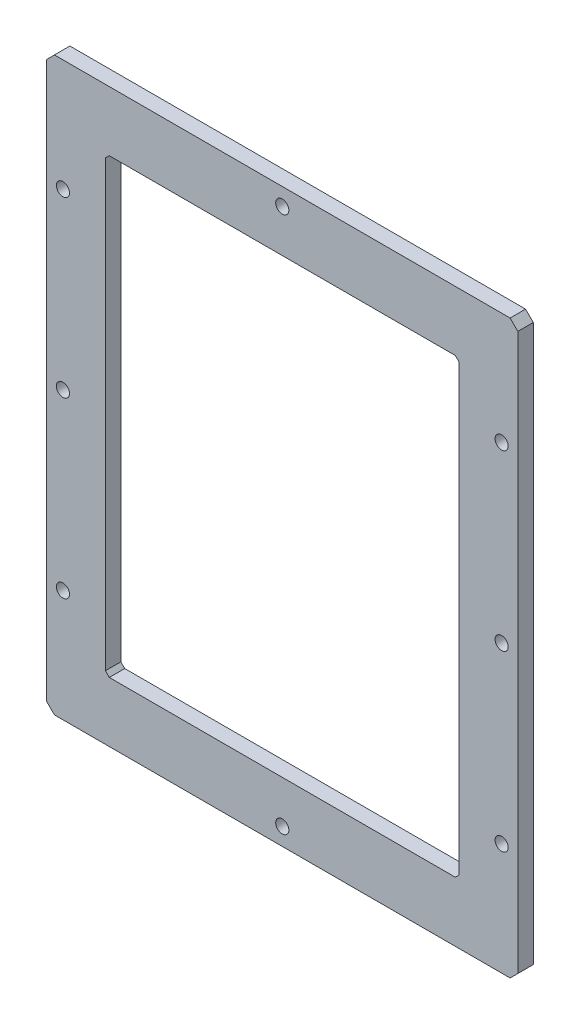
ISO-10303-21;
HEADER;
FILE_DESCRIPTION(('STEP AP214'),'2;1');
FILE_NAME('part.step','',(''),(''),'','','');
FILE_SCHEMA(('AUTOMOTIVE_DESIGN { 1 0 10303 214 1 1 1 1 }'));
ENDSEC;
DATA;
#1=APPLICATION_CONTEXT('core data for automotive mechanical design processes');
#2=APPLICATION_PROTOCOL_DEFINITION('international standard','automotive_design',2000,#1);
#3=PRODUCT_CONTEXT('',#1,'mechanical');
#4=PRODUCT('Part','Part','',(#3));
#5=PRODUCT_RELATED_PRODUCT_CATEGORY('part','',(#4));
#6=PRODUCT_DEFINITION_FORMATION('','',#4);
#7=PRODUCT_DEFINITION_CONTEXT('part definition',#1,'design');
#8=PRODUCT_DEFINITION('design','',#6,#7);
#9=PRODUCT_DEFINITION_SHAPE('','',#8);
#10=(LENGTH_UNIT() NAMED_UNIT(*) SI_UNIT(.MILLI.,.METRE.));
#11=(NAMED_UNIT(*) PLANE_ANGLE_UNIT() SI_UNIT($,.RADIAN.));
#12=(NAMED_UNIT(*) SI_UNIT($,.STERADIAN.) SOLID_ANGLE_UNIT());
#13=UNCERTAINTY_MEASURE_WITH_UNIT(LENGTH_MEASURE(1.E-05),#10,'distance_accuracy_value','');
#14=(GEOMETRIC_REPRESENTATION_CONTEXT(3) GLOBAL_UNCERTAINTY_ASSIGNED_CONTEXT((#13)) GLOBAL_UNIT_ASSIGNED_CONTEXT((#10,
#11,#12)) REPRESENTATION_CONTEXT('',''));
#15=CARTESIAN_POINT('',(0.,0.,0.));
#16=DIRECTION('',(0.,0.,1.));
#17=DIRECTION('',(1.,0.,0.));
#18=AXIS2_PLACEMENT_3D('',#15,#16,#17);
#19=CARTESIAN_POINT('',(0.,0.,4.));
#20=DIRECTION('',(0.,0.,1.));
#21=DIRECTION('',(1.,0.,0.));
#22=AXIS2_PLACEMENT_3D('',#19,#20,#21);
#23=PLANE('',#22);
#24=CARTESIAN_POINT('',(0.,-69.5,4.));
#25=DIRECTION('',(0.,0.,1.));
#26=DIRECTION('',(1.,0.,0.));
#27=AXIS2_PLACEMENT_3D('',#24,#25,#26);
#28=CIRCLE('',#27,1.7);
#29=CARTESIAN_POINT('',(1.7,-69.5,4.));
#30=VERTEX_POINT('',#29);
#31=EDGE_CURVE('E414',#30,#30,#28,.T.);
#32=ORIENTED_EDGE('',*,*,#31,.F.);
#33=EDGE_LOOP('',(#32));
#34=FACE_BOUND('',#33,.T.);
#35=CARTESIAN_POINT('',(56.8,0.,4.));
#36=DIRECTION('',(0.,0.,1.));
#37=DIRECTION('',(1.,0.,0.));
#38=AXIS2_PLACEMENT_3D('',#35,#36,#37);
#39=CIRCLE('',#38,1.7);
#40=CARTESIAN_POINT('',(58.5,0.,4.));
#41=VERTEX_POINT('',#40);
#42=EDGE_CURVE('E426',#41,#41,#39,.T.);
#43=ORIENTED_EDGE('',*,*,#42,.F.);
#44=EDGE_LOOP('',(#43));
#45=FACE_BOUND('',#44,.T.);
#46=CARTESIAN_POINT('',(-56.8,45.,4.));
#47=DIRECTION('',(0.,0.,1.));
#48=DIRECTION('',(1.,0.,0.));
#49=AXIS2_PLACEMENT_3D('',#46,#47,#48);
#50=CIRCLE('',#49,1.7);
#51=CARTESIAN_POINT('',(-55.1,45.,4.));
#52=VERTEX_POINT('',#51);
#53=EDGE_CURVE('E438',#52,#52,#50,.T.);
#54=ORIENTED_EDGE('',*,*,#53,.F.);
#55=EDGE_LOOP('',(#54));
#56=FACE_BOUND('',#55,.T.);
#57=CARTESIAN_POINT('',(-56.8,-45.,4.));
#58=DIRECTION('',(0.,0.,1.));
#59=DIRECTION('',(1.,0.,0.));
#60=AXIS2_PLACEMENT_3D('',#57,#58,#59);
#61=CIRCLE('',#60,1.7);
#62=CARTESIAN_POINT('',(-55.1,-45.,4.));
#63=VERTEX_POINT('',#62);
#64=EDGE_CURVE('E194',#63,#63,#61,.T.);
#65=ORIENTED_EDGE('',*,*,#64,.F.);
#66=EDGE_LOOP('',(#65));
#67=FACE_BOUND('',#66,.T.);
#68=DIRECTION('',(0.707106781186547,-0.707106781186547,0.));
#69=VECTOR('',#68,1.);
#70=CARTESIAN_POINT('',(-61.,-72.,4.));
#71=LINE('',#70,#69);
#72=CARTESIAN_POINT('',(-61.,-72.,4.));
#73=VERTEX_POINT('',#72);
#74=CARTESIAN_POINT('',(-59.,-74.,4.));
#75=VERTEX_POINT('',#74);
#76=EDGE_CURVE('E224',#73,#75,#71,.T.);
#77=ORIENTED_EDGE('',*,*,#76,.T.);
#78=DIRECTION('',(1.,0.,0.));
#79=VECTOR('',#78,1.);
#80=CARTESIAN_POINT('',(-59.,-74.,4.));
#81=LINE('',#80,#79);
#82=CARTESIAN_POINT('',(59.,-74.,4.));
#83=VERTEX_POINT('',#82);
#84=EDGE_CURVE('E227',#75,#83,#81,.T.);
#85=ORIENTED_EDGE('',*,*,#84,.T.);
#86=DIRECTION('',(0.707106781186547,0.707106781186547,0.));
#87=VECTOR('',#86,1.);
#88=CARTESIAN_POINT('',(59.,-74.,4.));
#89=LINE('',#88,#87);
#90=CARTESIAN_POINT('',(61.,-72.,4.));
#91=VERTEX_POINT('',#90);
#92=EDGE_CURVE('E230',#83,#91,#89,.T.);
#93=ORIENTED_EDGE('',*,*,#92,.T.);
#94=DIRECTION('',(0.,1.,0.));
#95=VECTOR('',#94,1.);
#96=CARTESIAN_POINT('',(61.,-72.,4.));
#97=LINE('',#96,#95);
#98=CARTESIAN_POINT('',(61.,72.,4.));
#99=VERTEX_POINT('',#98);
#100=EDGE_CURVE('E232',#91,#99,#97,.T.);
#101=ORIENTED_EDGE('',*,*,#100,.T.);
#102=DIRECTION('',(-0.707106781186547,0.707106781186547,0.));
#103=VECTOR('',#102,1.);
#104=CARTESIAN_POINT('',(61.,72.,4.));
#105=LINE('',#104,#103);
#106=CARTESIAN_POINT('',(59.,74.,4.));
#107=VERTEX_POINT('',#106);
#108=EDGE_CURVE('E234',#99,#107,#105,.T.);
#109=ORIENTED_EDGE('',*,*,#108,.T.);
#110=DIRECTION('',(-1.,0.,0.));
#111=VECTOR('',#110,1.);
#112=CARTESIAN_POINT('',(59.,74.,4.));
#113=LINE('',#112,#111);
#114=CARTESIAN_POINT('',(-59.,74.,4.));
#115=VERTEX_POINT('',#114);
#116=EDGE_CURVE('E236',#107,#115,#113,.T.);
#117=ORIENTED_EDGE('',*,*,#116,.T.);
#118=DIRECTION('',(-0.707106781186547,-0.707106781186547,0.));
#119=VECTOR('',#118,1.);
#120=CARTESIAN_POINT('',(-59.,74.,4.));
#121=LINE('',#120,#119);
#122=CARTESIAN_POINT('',(-61.,72.,4.));
#123=VERTEX_POINT('',#122);
#124=EDGE_CURVE('E238',#115,#123,#121,.T.);
#125=ORIENTED_EDGE('',*,*,#124,.T.);
#126=DIRECTION('',(0.,-1.,0.));
#127=VECTOR('',#126,1.);
#128=CARTESIAN_POINT('',(-61.,72.,4.));
#129=LINE('',#128,#127);
#130=EDGE_CURVE('E240',#123,#73,#129,.T.);
#131=ORIENTED_EDGE('',*,*,#130,.T.);
#132=EDGE_LOOP('',(#77,#85,#93,#101,#109,#117,#125,#131));
#133=FACE_BOUND('',#132,.T.);
#134=DIRECTION('',(1.,0.,0.));
#135=VECTOR('',#134,1.);
#136=CARTESIAN_POINT('',(-44.8,-58.5,4.));
#137=LINE('',#136,#135);
#138=CARTESIAN_POINT('',(-44.8,-58.5,4.));
#139=VERTEX_POINT('',#138);
#140=CARTESIAN_POINT('',(44.8,-58.5,4.));
#141=VERTEX_POINT('',#140);
#142=EDGE_CURVE('E164',#139,#141,#137,.T.);
#143=ORIENTED_EDGE('',*,*,#142,.F.);
#144=DIRECTION('',(0.707106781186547,-0.707106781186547,0.));
#145=VECTOR('',#144,1.);
#146=CARTESIAN_POINT('',(-45.8,-57.5,4.));
#147=LINE('',#146,#145);
#148=CARTESIAN_POINT('',(-45.8,-57.5,4.));
#149=VERTEX_POINT('',#148);
#150=EDGE_CURVE('E156',#149,#139,#147,.T.);
#151=ORIENTED_EDGE('',*,*,#150,.F.);
#152=DIRECTION('',(0.,-1.,0.));
#153=VECTOR('',#152,1.);
#154=CARTESIAN_POINT('',(-45.8,57.5,4.));
#155=LINE('',#154,#153);
#156=CARTESIAN_POINT('',(-45.8,57.5,4.));
#157=VERTEX_POINT('',#156);
#158=EDGE_CURVE('E191',#157,#149,#155,.T.);
#159=ORIENTED_EDGE('',*,*,#158,.F.);
#160=DIRECTION('',(-0.707106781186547,-0.707106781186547,0.));
#161=VECTOR('',#160,1.);
#162=CARTESIAN_POINT('',(-44.8,58.5,4.));
#163=LINE('',#162,#161);
#164=CARTESIAN_POINT('',(-44.8,58.5,4.));
#165=VERTEX_POINT('',#164);
#166=EDGE_CURVE('E189',#165,#157,#163,.T.);
#167=ORIENTED_EDGE('',*,*,#166,.F.);
#168=DIRECTION('',(-1.,0.,0.));
#169=VECTOR('',#168,1.);
#170=CARTESIAN_POINT('',(44.8,58.5,4.));
#171=LINE('',#170,#169);
#172=CARTESIAN_POINT('',(44.8,58.5,4.));
#173=VERTEX_POINT('',#172);
#174=EDGE_CURVE('E187',#173,#165,#171,.T.);
#175=ORIENTED_EDGE('',*,*,#174,.F.);
#176=DIRECTION('',(-0.707106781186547,0.707106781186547,0.));
#177=VECTOR('',#176,1.);
#178=CARTESIAN_POINT('',(45.8,57.5,4.));
#179=LINE('',#178,#177);
#180=CARTESIAN_POINT('',(45.8,57.5,4.));
#181=VERTEX_POINT('',#180);
#182=EDGE_CURVE('E185',#181,#173,#179,.T.);
#183=ORIENTED_EDGE('',*,*,#182,.F.);
#184=DIRECTION('',(0.,1.,0.));
#185=VECTOR('',#184,1.);
#186=CARTESIAN_POINT('',(45.8,-57.5,4.));
#187=LINE('',#186,#185);
#188=CARTESIAN_POINT('',(45.8,-57.5,4.));
#189=VERTEX_POINT('',#188);
#190=EDGE_CURVE('E180',#189,#181,#187,.T.);
#191=ORIENTED_EDGE('',*,*,#190,.F.);
#192=DIRECTION('',(0.707106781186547,0.707106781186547,0.));
#193=VECTOR('',#192,1.);
#194=CARTESIAN_POINT('',(44.8,-58.5,4.));
#195=LINE('',#194,#193);
#196=EDGE_CURVE('E178',#141,#189,#195,.T.);
#197=ORIENTED_EDGE('',*,*,#196,.F.);
#198=EDGE_LOOP('',(#143,#151,#159,#167,#175,#183,#191,#197));
#199=FACE_BOUND('',#198,.T.);
#200=CARTESIAN_POINT('',(-56.8,0.,4.));
#201=DIRECTION('',(0.,0.,1.));
#202=DIRECTION('',(1.,0.,0.));
#203=AXIS2_PLACEMENT_3D('',#200,#201,#202);
#204=CIRCLE('',#203,1.7);
#205=CARTESIAN_POINT('',(-55.1,0.,4.));
#206=VERTEX_POINT('',#205);
#207=EDGE_CURVE('E444',#206,#206,#204,.T.);
#208=ORIENTED_EDGE('',*,*,#207,.F.);
#209=EDGE_LOOP('',(#208));
#210=FACE_BOUND('',#209,.T.);
#211=CARTESIAN_POINT('',(56.8,-45.,4.));
#212=DIRECTION('',(0.,0.,1.));
#213=DIRECTION('',(1.,0.,0.));
#214=AXIS2_PLACEMENT_3D('',#211,#212,#213);
#215=CIRCLE('',#214,1.7);
#216=CARTESIAN_POINT('',(58.5,-45.,4.));
#217=VERTEX_POINT('',#216);
#218=EDGE_CURVE('E432',#217,#217,#215,.T.);
#219=ORIENTED_EDGE('',*,*,#218,.F.);
#220=EDGE_LOOP('',(#219));
#221=FACE_BOUND('',#220,.T.);
#222=CARTESIAN_POINT('',(56.8,45.,4.));
#223=DIRECTION('',(0.,0.,1.));
#224=DIRECTION('',(1.,0.,0.));
#225=AXIS2_PLACEMENT_3D('',#222,#223,#224);
#226=CIRCLE('',#225,1.7);
#227=CARTESIAN_POINT('',(58.5,45.,4.));
#228=VERTEX_POINT('',#227);
#229=EDGE_CURVE('E420',#228,#228,#226,.T.);
#230=ORIENTED_EDGE('',*,*,#229,.F.);
#231=EDGE_LOOP('',(#230));
#232=FACE_BOUND('',#231,.T.);
#233=CARTESIAN_POINT('',(0.,69.5,4.));
#234=DIRECTION('',(0.,0.,1.));
#235=DIRECTION('',(1.,0.,0.));
#236=AXIS2_PLACEMENT_3D('',#233,#234,#235);
#237=CIRCLE('',#236,1.7);
#238=CARTESIAN_POINT('',(1.7,69.5,4.));
#239=VERTEX_POINT('',#238);
#240=EDGE_CURVE('E405',#239,#239,#237,.T.);
#241=ORIENTED_EDGE('',*,*,#240,.F.);
#242=EDGE_LOOP('',(#241));
#243=FACE_BOUND('',#242,.T.);
#244=ADVANCED_FACE('F43',(#34,#45,#56,#67,#133,#199,#210,#221,#232,#243),#23,.T.);
#245=CARTESIAN_POINT('',(0.,0.,0.));
#246=DIRECTION('',(0.,0.,1.));
#247=DIRECTION('',(1.,0.,0.));
#248=AXIS2_PLACEMENT_3D('',#245,#246,#247);
#249=PLANE('',#248);
#250=DIRECTION('',(0.707106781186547,-0.707106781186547,0.));
#251=VECTOR('',#250,1.);
#252=CARTESIAN_POINT('',(-61.,-72.,0.));
#253=LINE('',#252,#251);
#254=CARTESIAN_POINT('',(-61.,-72.,0.));
#255=VERTEX_POINT('',#254);
#256=CARTESIAN_POINT('',(-59.,-74.,0.));
#257=VERTEX_POINT('',#256);
#258=EDGE_CURVE('E172',#255,#257,#253,.T.);
#259=ORIENTED_EDGE('',*,*,#258,.F.);
#260=DIRECTION('',(0.,-1.,0.));
#261=VECTOR('',#260,1.);
#262=CARTESIAN_POINT('',(-61.,72.,0.));
#263=LINE('',#262,#261);
#264=CARTESIAN_POINT('',(-61.,72.,0.));
#265=VERTEX_POINT('',#264);
#266=EDGE_CURVE('E228',#265,#255,#263,.T.);
#267=ORIENTED_EDGE('',*,*,#266,.F.);
#268=DIRECTION('',(-0.707106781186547,-0.707106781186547,0.));
#269=VECTOR('',#268,1.);
#270=CARTESIAN_POINT('',(-59.,74.,0.));
#271=LINE('',#270,#269);
#272=CARTESIAN_POINT('',(-59.,74.,0.));
#273=VERTEX_POINT('',#272);
#274=EDGE_CURVE('E255',#273,#265,#271,.T.);
#275=ORIENTED_EDGE('',*,*,#274,.F.);
#276=DIRECTION('',(-1.,0.,0.));
#277=VECTOR('',#276,1.);
#278=CARTESIAN_POINT('',(59.,74.,0.));
#279=LINE('',#278,#277);
#280=CARTESIAN_POINT('',(59.,74.,0.));
#281=VERTEX_POINT('',#280);
#282=EDGE_CURVE('E253',#281,#273,#279,.T.);
#283=ORIENTED_EDGE('',*,*,#282,.F.);
#284=DIRECTION('',(-0.707106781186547,0.707106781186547,0.));
#285=VECTOR('',#284,1.);
#286=CARTESIAN_POINT('',(61.,72.,0.));
#287=LINE('',#286,#285);
#288=CARTESIAN_POINT('',(61.,72.,0.));
#289=VERTEX_POINT('',#288);
#290=EDGE_CURVE('E251',#289,#281,#287,.T.);
#291=ORIENTED_EDGE('',*,*,#290,.F.);
#292=DIRECTION('',(0.,1.,0.));
#293=VECTOR('',#292,1.);
#294=CARTESIAN_POINT('',(61.,-72.,0.));
#295=LINE('',#294,#293);
#296=CARTESIAN_POINT('',(61.,-72.,0.));
#297=VERTEX_POINT('',#296);
#298=EDGE_CURVE('E249',#297,#289,#295,.T.);
#299=ORIENTED_EDGE('',*,*,#298,.F.);
#300=DIRECTION('',(0.707106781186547,0.707106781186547,0.));
#301=VECTOR('',#300,1.);
#302=CARTESIAN_POINT('',(59.,-74.,0.));
#303=LINE('',#302,#301);
#304=CARTESIAN_POINT('',(59.,-74.,0.));
#305=VERTEX_POINT('',#304);
#306=EDGE_CURVE('E247',#305,#297,#303,.T.);
#307=ORIENTED_EDGE('',*,*,#306,.F.);
#308=DIRECTION('',(1.,0.,0.));
#309=VECTOR('',#308,1.);
#310=CARTESIAN_POINT('',(-59.,-74.,0.));
#311=LINE('',#310,#309);
#312=EDGE_CURVE('E245',#257,#305,#311,.T.);
#313=ORIENTED_EDGE('',*,*,#312,.F.);
#314=EDGE_LOOP('',(#259,#267,#275,#283,#291,#299,#307,#313));
#315=FACE_BOUND('',#314,.T.);
#316=DIRECTION('',(0.707106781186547,-0.707106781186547,0.));
#317=VECTOR('',#316,1.);
#318=CARTESIAN_POINT('',(-45.8,-57.5,0.));
#319=LINE('',#318,#317);
#320=CARTESIAN_POINT('',(-45.8,-57.5,0.));
#321=VERTEX_POINT('',#320);
#322=CARTESIAN_POINT('',(-44.8,-58.5,0.));
#323=VERTEX_POINT('',#322);
#324=EDGE_CURVE('E66',#321,#323,#319,.T.);
#325=ORIENTED_EDGE('',*,*,#324,.T.);
#326=DIRECTION('',(1.,0.,0.));
#327=VECTOR('',#326,1.);
#328=CARTESIAN_POINT('',(-44.8,-58.5,0.));
#329=LINE('',#328,#327);
#330=CARTESIAN_POINT('',(44.8,-58.5,0.));
#331=VERTEX_POINT('',#330);
#332=EDGE_CURVE('E171',#323,#331,#329,.T.);
#333=ORIENTED_EDGE('',*,*,#332,.T.);
#334=DIRECTION('',(0.707106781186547,0.707106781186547,0.));
#335=VECTOR('',#334,1.);
#336=CARTESIAN_POINT('',(44.8,-58.5,0.));
#337=LINE('',#336,#335);
#338=CARTESIAN_POINT('',(45.8,-57.5,0.));
#339=VERTEX_POINT('',#338);
#340=EDGE_CURVE('E196',#331,#339,#337,.T.);
#341=ORIENTED_EDGE('',*,*,#340,.T.);
#342=DIRECTION('',(0.,1.,0.));
#343=VECTOR('',#342,1.);
#344=CARTESIAN_POINT('',(45.8,-57.5,0.));
#345=LINE('',#344,#343);
#346=CARTESIAN_POINT('',(45.8,57.5,0.));
#347=VERTEX_POINT('',#346);
#348=EDGE_CURVE('E199',#339,#347,#345,.T.);
#349=ORIENTED_EDGE('',*,*,#348,.T.);
#350=DIRECTION('',(-0.707106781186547,0.707106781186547,0.));
#351=VECTOR('',#350,1.);
#352=CARTESIAN_POINT('',(45.8,57.5,0.));
#353=LINE('',#352,#351);
#354=CARTESIAN_POINT('',(44.8,58.5,0.));
#355=VERTEX_POINT('',#354);
#356=EDGE_CURVE('E202',#347,#355,#353,.T.);
#357=ORIENTED_EDGE('',*,*,#356,.T.);
#358=DIRECTION('',(-1.,0.,0.));
#359=VECTOR('',#358,1.);
#360=CARTESIAN_POINT('',(44.8,58.5,0.));
#361=LINE('',#360,#359);
#362=CARTESIAN_POINT('',(-44.8,58.5,0.));
#363=VERTEX_POINT('',#362);
#364=EDGE_CURVE('E205',#355,#363,#361,.T.);
#365=ORIENTED_EDGE('',*,*,#364,.T.);
#366=DIRECTION('',(-0.707106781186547,-0.707106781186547,0.));
#367=VECTOR('',#366,1.);
#368=CARTESIAN_POINT('',(-44.8,58.5,0.));
#369=LINE('',#368,#367);
#370=CARTESIAN_POINT('',(-45.8,57.5,0.));
#371=VERTEX_POINT('',#370);
#372=EDGE_CURVE('E208',#363,#371,#369,.T.);
#373=ORIENTED_EDGE('',*,*,#372,.T.);
#374=DIRECTION('',(0.,-1.,0.));
#375=VECTOR('',#374,1.);
#376=CARTESIAN_POINT('',(-45.8,57.5,0.));
#377=LINE('',#376,#375);
#378=EDGE_CURVE('E165',#371,#321,#377,.T.);
#379=ORIENTED_EDGE('',*,*,#378,.T.);
#380=EDGE_LOOP('',(#325,#333,#341,#349,#357,#365,#373,#379));
#381=FACE_BOUND('',#380,.T.);
#382=CARTESIAN_POINT('',(-56.8,-45.,0.));
#383=DIRECTION('',(0.,0.,1.));
#384=DIRECTION('',(1.,0.,0.));
#385=AXIS2_PLACEMENT_3D('',#382,#383,#384);
#386=CIRCLE('',#385,1.7);
#387=CARTESIAN_POINT('',(-55.1,-45.,0.));
#388=VERTEX_POINT('',#387);
#389=EDGE_CURVE('E447',#388,#388,#386,.T.);
#390=ORIENTED_EDGE('',*,*,#389,.T.);
#391=EDGE_LOOP('',(#390));
#392=FACE_BOUND('',#391,.T.);
#393=CARTESIAN_POINT('',(-56.8,0.,0.));
#394=DIRECTION('',(0.,0.,1.));
#395=DIRECTION('',(1.,0.,0.));
#396=AXIS2_PLACEMENT_3D('',#393,#394,#395);
#397=CIRCLE('',#396,1.7);
#398=CARTESIAN_POINT('',(-55.1,0.,0.));
#399=VERTEX_POINT('',#398);
#400=EDGE_CURVE('E441',#399,#399,#397,.T.);
#401=ORIENTED_EDGE('',*,*,#400,.T.);
#402=EDGE_LOOP('',(#401));
#403=FACE_BOUND('',#402,.T.);
#404=CARTESIAN_POINT('',(-56.8,45.,0.));
#405=DIRECTION('',(0.,0.,1.));
#406=DIRECTION('',(1.,0.,0.));
#407=AXIS2_PLACEMENT_3D('',#404,#405,#406);
#408=CIRCLE('',#407,1.7);
#409=CARTESIAN_POINT('',(-55.1,45.,0.));
#410=VERTEX_POINT('',#409);
#411=EDGE_CURVE('E435',#410,#410,#408,.T.);
#412=ORIENTED_EDGE('',*,*,#411,.T.);
#413=EDGE_LOOP('',(#412));
#414=FACE_BOUND('',#413,.T.);
#415=CARTESIAN_POINT('',(56.8,-45.,0.));
#416=DIRECTION('',(0.,0.,1.));
#417=DIRECTION('',(1.,0.,0.));
#418=AXIS2_PLACEMENT_3D('',#415,#416,#417);
#419=CIRCLE('',#418,1.7);
#420=CARTESIAN_POINT('',(58.5,-45.,0.));
#421=VERTEX_POINT('',#420);
#422=EDGE_CURVE('E429',#421,#421,#419,.T.);
#423=ORIENTED_EDGE('',*,*,#422,.T.);
#424=EDGE_LOOP('',(#423));
#425=FACE_BOUND('',#424,.T.);
#426=CARTESIAN_POINT('',(56.8,0.,0.));
#427=DIRECTION('',(0.,0.,1.));
#428=DIRECTION('',(1.,0.,0.));
#429=AXIS2_PLACEMENT_3D('',#426,#427,#428);
#430=CIRCLE('',#429,1.7);
#431=CARTESIAN_POINT('',(58.5,0.,0.));
#432=VERTEX_POINT('',#431);
#433=EDGE_CURVE('E423',#432,#432,#430,.T.);
#434=ORIENTED_EDGE('',*,*,#433,.T.);
#435=EDGE_LOOP('',(#434));
#436=FACE_BOUND('',#435,.T.);
#437=CARTESIAN_POINT('',(56.8,45.,0.));
#438=DIRECTION('',(0.,0.,1.));
#439=DIRECTION('',(1.,0.,0.));
#440=AXIS2_PLACEMENT_3D('',#437,#438,#439);
#441=CIRCLE('',#440,1.7);
#442=CARTESIAN_POINT('',(58.5,45.,0.));
#443=VERTEX_POINT('',#442);
#444=EDGE_CURVE('E417',#443,#443,#441,.T.);
#445=ORIENTED_EDGE('',*,*,#444,.T.);
#446=EDGE_LOOP('',(#445));
#447=FACE_BOUND('',#446,.T.);
#448=CARTESIAN_POINT('',(0.,-69.5,0.));
#449=DIRECTION('',(0.,0.,1.));
#450=DIRECTION('',(1.,0.,0.));
#451=AXIS2_PLACEMENT_3D('',#448,#449,#450);
#452=CIRCLE('',#451,1.7);
#453=CARTESIAN_POINT('',(1.7,-69.5,0.));
#454=VERTEX_POINT('',#453);
#455=EDGE_CURVE('E411',#454,#454,#452,.T.);
#456=ORIENTED_EDGE('',*,*,#455,.T.);
#457=EDGE_LOOP('',(#456));
#458=FACE_BOUND('',#457,.T.);
#459=CARTESIAN_POINT('',(0.,69.5,0.));
#460=DIRECTION('',(0.,0.,1.));
#461=DIRECTION('',(1.,0.,0.));
#462=AXIS2_PLACEMENT_3D('',#459,#460,#461);
#463=CIRCLE('',#462,1.7);
#464=CARTESIAN_POINT('',(1.7,69.5,0.));
#465=VERTEX_POINT('',#464);
#466=EDGE_CURVE('E408',#465,#465,#463,.T.);
#467=ORIENTED_EDGE('',*,*,#466,.T.);
#468=EDGE_LOOP('',(#467));
#469=FACE_BOUND('',#468,.T.);
#470=ADVANCED_FACE('F285',(#315,#381,#392,#403,#414,#425,#436,#447,#458,#469),#249,.F.);
#471=CARTESIAN_POINT('',(-61.,-72.,4.));
#472=DIRECTION('',(0.707106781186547,0.707106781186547,0.));
#473=DIRECTION('',(-0.707106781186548,0.707106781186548,0.));
#474=AXIS2_PLACEMENT_3D('',#471,#472,#473);
#475=PLANE('',#474);
#476=ORIENTED_EDGE('',*,*,#258,.T.);
#477=DIRECTION('',(0.,0.,-1.));
#478=VECTOR('',#477,1.);
#479=CARTESIAN_POINT('',(-59.,-74.,4.));
#480=LINE('',#479,#478);
#481=EDGE_CURVE('E11',#75,#257,#480,.T.);
#482=ORIENTED_EDGE('',*,*,#481,.F.);
#483=ORIENTED_EDGE('',*,*,#76,.F.);
#484=DIRECTION('',(0.,0.,-1.));
#485=VECTOR('',#484,1.);
#486=CARTESIAN_POINT('',(-61.,-72.,4.));
#487=LINE('',#486,#485);
#488=EDGE_CURVE('E242',#73,#255,#487,.T.);
#489=ORIENTED_EDGE('',*,*,#488,.T.);
#490=EDGE_LOOP('',(#476,#482,#483,#489));
#491=FACE_BOUND('',#490,.T.);
#492=ADVANCED_FACE('F45',(#491),#475,.F.);
#493=CARTESIAN_POINT('',(-59.,-74.,4.));
#494=DIRECTION('',(0.,1.,0.));
#495=DIRECTION('',(0.,0.,1.));
#496=AXIS2_PLACEMENT_3D('',#493,#494,#495);
#497=PLANE('',#496);
#498=ORIENTED_EDGE('',*,*,#312,.T.);
#499=DIRECTION('',(0.,0.,-1.));
#500=VECTOR('',#499,1.);
#501=CARTESIAN_POINT('',(59.,-74.,4.));
#502=LINE('',#501,#500);
#503=EDGE_CURVE('E51',#83,#305,#502,.T.);
#504=ORIENTED_EDGE('',*,*,#503,.F.);
#505=ORIENTED_EDGE('',*,*,#84,.F.);
#506=ORIENTED_EDGE('',*,*,#481,.T.);
#507=EDGE_LOOP('',(#498,#504,#505,#506));
#508=FACE_BOUND('',#507,.T.);
#509=ADVANCED_FACE('F302',(#508),#497,.F.);
#510=CARTESIAN_POINT('',(59.,-74.,4.));
#511=DIRECTION('',(-0.707106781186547,0.707106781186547,0.));
#512=DIRECTION('',(-0.707106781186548,-0.707106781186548,0.));
#513=AXIS2_PLACEMENT_3D('',#510,#511,#512);
#514=PLANE('',#513);
#515=ORIENTED_EDGE('',*,*,#306,.T.);
#516=DIRECTION('',(0.,0.,-1.));
#517=VECTOR('',#516,1.);
#518=CARTESIAN_POINT('',(61.,-72.,4.));
#519=LINE('',#518,#517);
#520=EDGE_CURVE('E272',#91,#297,#519,.T.);
#521=ORIENTED_EDGE('',*,*,#520,.F.);
#522=ORIENTED_EDGE('',*,*,#92,.F.);
#523=ORIENTED_EDGE('',*,*,#503,.T.);
#524=EDGE_LOOP('',(#515,#521,#522,#523));
#525=FACE_BOUND('',#524,.T.);
#526=ADVANCED_FACE('F279',(#525),#514,.F.);
#527=CARTESIAN_POINT('',(61.,-72.,4.));
#528=DIRECTION('',(-1.,0.,0.));
#529=DIRECTION('',(0.,0.,1.));
#530=AXIS2_PLACEMENT_3D('',#527,#528,#529);
#531=PLANE('',#530);
#532=ORIENTED_EDGE('',*,*,#298,.T.);
#533=DIRECTION('',(0.,0.,-1.));
#534=VECTOR('',#533,1.);
#535=CARTESIAN_POINT('',(61.,72.,4.));
#536=LINE('',#535,#534);
#537=EDGE_CURVE('E269',#99,#289,#536,.T.);
#538=ORIENTED_EDGE('',*,*,#537,.F.);
#539=ORIENTED_EDGE('',*,*,#100,.F.);
#540=ORIENTED_EDGE('',*,*,#520,.T.);
#541=EDGE_LOOP('',(#532,#538,#539,#540));
#542=FACE_BOUND('',#541,.T.);
#543=ADVANCED_FACE('F291',(#542),#531,.F.);
#544=CARTESIAN_POINT('',(61.,72.,4.));
#545=DIRECTION('',(-0.707106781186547,-0.707106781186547,0.));
#546=DIRECTION('',(0.707106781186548,-0.707106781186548,0.));
#547=AXIS2_PLACEMENT_3D('',#544,#545,#546);
#548=PLANE('',#547);
#549=ORIENTED_EDGE('',*,*,#290,.T.);
#550=DIRECTION('',(0.,0.,-1.));
#551=VECTOR('',#550,1.);
#552=CARTESIAN_POINT('',(59.,74.,4.));
#553=LINE('',#552,#551);
#554=EDGE_CURVE('E266',#107,#281,#553,.T.);
#555=ORIENTED_EDGE('',*,*,#554,.F.);
#556=ORIENTED_EDGE('',*,*,#108,.F.);
#557=ORIENTED_EDGE('',*,*,#537,.T.);
#558=EDGE_LOOP('',(#549,#555,#556,#557));
#559=FACE_BOUND('',#558,.T.);
#560=ADVANCED_FACE('F295',(#559),#548,.F.);
#561=CARTESIAN_POINT('',(59.,74.,4.));
#562=DIRECTION('',(0.,-1.,0.));
#563=DIRECTION('',(0.,0.,-1.));
#564=AXIS2_PLACEMENT_3D('',#561,#562,#563);
#565=PLANE('',#564);
#566=ORIENTED_EDGE('',*,*,#282,.T.);
#567=DIRECTION('',(0.,0.,-1.));
#568=VECTOR('',#567,1.);
#569=CARTESIAN_POINT('',(-59.,74.,4.));
#570=LINE('',#569,#568);
#571=EDGE_CURVE('E263',#115,#273,#570,.T.);
#572=ORIENTED_EDGE('',*,*,#571,.F.);
#573=ORIENTED_EDGE('',*,*,#116,.F.);
#574=ORIENTED_EDGE('',*,*,#554,.T.);
#575=EDGE_LOOP('',(#566,#572,#573,#574));
#576=FACE_BOUND('',#575,.T.);
#577=ADVANCED_FACE('F315',(#576),#565,.F.);
#578=CARTESIAN_POINT('',(-59.,74.,4.));
#579=DIRECTION('',(0.707106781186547,-0.707106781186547,0.));
#580=DIRECTION('',(0.707106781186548,0.707106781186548,0.));
#581=AXIS2_PLACEMENT_3D('',#578,#579,#580);
#582=PLANE('',#581);
#583=ORIENTED_EDGE('',*,*,#274,.T.);
#584=DIRECTION('',(0.,0.,-1.));
#585=VECTOR('',#584,1.);
#586=CARTESIAN_POINT('',(-61.,72.,4.));
#587=LINE('',#586,#585);
#588=EDGE_CURVE('E260',#123,#265,#587,.T.);
#589=ORIENTED_EDGE('',*,*,#588,.F.);
#590=ORIENTED_EDGE('',*,*,#124,.F.);
#591=ORIENTED_EDGE('',*,*,#571,.T.);
#592=EDGE_LOOP('',(#583,#589,#590,#591));
#593=FACE_BOUND('',#592,.T.);
#594=ADVANCED_FACE('F313',(#593),#582,.F.);
#595=CARTESIAN_POINT('',(-61.,72.,4.));
#596=DIRECTION('',(1.,0.,0.));
#597=DIRECTION('',(0.,0.,-1.));
#598=AXIS2_PLACEMENT_3D('',#595,#596,#597);
#599=PLANE('',#598);
#600=ORIENTED_EDGE('',*,*,#266,.T.);
#601=ORIENTED_EDGE('',*,*,#488,.F.);
#602=ORIENTED_EDGE('',*,*,#130,.F.);
#603=ORIENTED_EDGE('',*,*,#588,.T.);
#604=EDGE_LOOP('',(#600,#601,#602,#603));
#605=FACE_BOUND('',#604,.T.);
#606=ADVANCED_FACE('F308',(#605),#599,.F.);
#607=CARTESIAN_POINT('',(-45.8,-57.5,4.));
#608=DIRECTION('',(0.707106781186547,0.707106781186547,0.));
#609=DIRECTION('',(-0.707106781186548,0.707106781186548,0.));
#610=AXIS2_PLACEMENT_3D('',#607,#608,#609);
#611=PLANE('',#610);
#612=ORIENTED_EDGE('',*,*,#324,.F.);
#613=DIRECTION('',(0.,0.,-1.));
#614=VECTOR('',#613,1.);
#615=CARTESIAN_POINT('',(-45.8,-57.5,4.));
#616=LINE('',#615,#614);
#617=EDGE_CURVE('E160',#149,#321,#616,.T.);
#618=ORIENTED_EDGE('',*,*,#617,.F.);
#619=ORIENTED_EDGE('',*,*,#150,.T.);
#620=DIRECTION('',(0.,0.,-1.));
#621=VECTOR('',#620,1.);
#622=CARTESIAN_POINT('',(-44.8,-58.5,4.));
#623=LINE('',#622,#621);
#624=EDGE_CURVE('E159',#139,#323,#623,.T.);
#625=ORIENTED_EDGE('',*,*,#624,.T.);
#626=EDGE_LOOP('',(#612,#618,#619,#625));
#627=FACE_BOUND('',#626,.T.);
#628=ADVANCED_FACE('F158',(#627),#611,.T.);
#629=CARTESIAN_POINT('',(-44.8,-58.5,4.));
#630=DIRECTION('',(0.,1.,0.));
#631=DIRECTION('',(0.,0.,1.));
#632=AXIS2_PLACEMENT_3D('',#629,#630,#631);
#633=PLANE('',#632);
#634=ORIENTED_EDGE('',*,*,#332,.F.);
#635=ORIENTED_EDGE('',*,*,#624,.F.);
#636=ORIENTED_EDGE('',*,*,#142,.T.);
#637=DIRECTION('',(0.,0.,-1.));
#638=VECTOR('',#637,1.);
#639=CARTESIAN_POINT('',(44.8,-58.5,4.));
#640=LINE('',#639,#638);
#641=EDGE_CURVE('E173',#141,#331,#640,.T.);
#642=ORIENTED_EDGE('',*,*,#641,.T.);
#643=EDGE_LOOP('',(#634,#635,#636,#642));
#644=FACE_BOUND('',#643,.T.);
#645=ADVANCED_FACE('F168',(#644),#633,.T.);
#646=CARTESIAN_POINT('',(44.8,-58.5,4.));
#647=DIRECTION('',(-0.707106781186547,0.707106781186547,0.));
#648=DIRECTION('',(-0.707106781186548,-0.707106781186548,0.));
#649=AXIS2_PLACEMENT_3D('',#646,#647,#648);
#650=PLANE('',#649);
#651=ORIENTED_EDGE('',*,*,#340,.F.);
#652=ORIENTED_EDGE('',*,*,#641,.F.);
#653=ORIENTED_EDGE('',*,*,#196,.T.);
#654=DIRECTION('',(0.,0.,-1.));
#655=VECTOR('',#654,1.);
#656=CARTESIAN_POINT('',(45.8,-57.5,4.));
#657=LINE('',#656,#655);
#658=EDGE_CURVE('E221',#189,#339,#657,.T.);
#659=ORIENTED_EDGE('',*,*,#658,.T.);
#660=EDGE_LOOP('',(#651,#652,#653,#659));
#661=FACE_BOUND('',#660,.T.);
#662=ADVANCED_FACE('F343',(#661),#650,.T.);
#663=CARTESIAN_POINT('',(45.8,-57.5,4.));
#664=DIRECTION('',(-1.,0.,0.));
#665=DIRECTION('',(0.,0.,1.));
#666=AXIS2_PLACEMENT_3D('',#663,#664,#665);
#667=PLANE('',#666);
#668=ORIENTED_EDGE('',*,*,#348,.F.);
#669=ORIENTED_EDGE('',*,*,#658,.F.);
#670=ORIENTED_EDGE('',*,*,#190,.T.);
#671=DIRECTION('',(0.,0.,-1.));
#672=VECTOR('',#671,1.);
#673=CARTESIAN_POINT('',(45.8,57.5,4.));
#674=LINE('',#673,#672);
#675=EDGE_CURVE('E219',#181,#347,#674,.T.);
#676=ORIENTED_EDGE('',*,*,#675,.T.);
#677=EDGE_LOOP('',(#668,#669,#670,#676));
#678=FACE_BOUND('',#677,.T.);
#679=ADVANCED_FACE('F347',(#678),#667,.T.);
#680=CARTESIAN_POINT('',(45.8,57.5,4.));
#681=DIRECTION('',(-0.707106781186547,-0.707106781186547,0.));
#682=DIRECTION('',(0.707106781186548,-0.707106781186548,0.));
#683=AXIS2_PLACEMENT_3D('',#680,#681,#682);
#684=PLANE('',#683);
#685=ORIENTED_EDGE('',*,*,#356,.F.);
#686=ORIENTED_EDGE('',*,*,#675,.F.);
#687=ORIENTED_EDGE('',*,*,#182,.T.);
#688=DIRECTION('',(0.,0.,-1.));
#689=VECTOR('',#688,1.);
#690=CARTESIAN_POINT('',(44.8,58.5,4.));
#691=LINE('',#690,#689);
#692=EDGE_CURVE('E217',#173,#355,#691,.T.);
#693=ORIENTED_EDGE('',*,*,#692,.T.);
#694=EDGE_LOOP('',(#685,#686,#687,#693));
#695=FACE_BOUND('',#694,.T.);
#696=ADVANCED_FACE('F353',(#695),#684,.T.);
#697=CARTESIAN_POINT('',(44.8,58.5,4.));
#698=DIRECTION('',(0.,-1.,0.));
#699=DIRECTION('',(0.,0.,-1.));
#700=AXIS2_PLACEMENT_3D('',#697,#698,#699);
#701=PLANE('',#700);
#702=ORIENTED_EDGE('',*,*,#364,.F.);
#703=ORIENTED_EDGE('',*,*,#692,.F.);
#704=ORIENTED_EDGE('',*,*,#174,.T.);
#705=DIRECTION('',(0.,0.,-1.));
#706=VECTOR('',#705,1.);
#707=CARTESIAN_POINT('',(-44.8,58.5,4.));
#708=LINE('',#707,#706);
#709=EDGE_CURVE('E215',#165,#363,#708,.T.);
#710=ORIENTED_EDGE('',*,*,#709,.T.);
#711=EDGE_LOOP('',(#702,#703,#704,#710));
#712=FACE_BOUND('',#711,.T.);
#713=ADVANCED_FACE('F357',(#712),#701,.T.);
#714=CARTESIAN_POINT('',(-44.8,58.5,4.));
#715=DIRECTION('',(0.707106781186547,-0.707106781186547,0.));
#716=DIRECTION('',(0.707106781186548,0.707106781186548,0.));
#717=AXIS2_PLACEMENT_3D('',#714,#715,#716);
#718=PLANE('',#717);
#719=ORIENTED_EDGE('',*,*,#372,.F.);
#720=ORIENTED_EDGE('',*,*,#709,.F.);
#721=ORIENTED_EDGE('',*,*,#166,.T.);
#722=DIRECTION('',(0.,0.,-1.));
#723=VECTOR('',#722,1.);
#724=CARTESIAN_POINT('',(-45.8,57.5,4.));
#725=LINE('',#724,#723);
#726=EDGE_CURVE('E58',#157,#371,#725,.T.);
#727=ORIENTED_EDGE('',*,*,#726,.T.);
#728=EDGE_LOOP('',(#719,#720,#721,#727));
#729=FACE_BOUND('',#728,.T.);
#730=ADVANCED_FACE('F361',(#729),#718,.T.);
#731=CARTESIAN_POINT('',(-45.8,57.5,4.));
#732=DIRECTION('',(1.,0.,0.));
#733=DIRECTION('',(0.,0.,-1.));
#734=AXIS2_PLACEMENT_3D('',#731,#732,#733);
#735=PLANE('',#734);
#736=ORIENTED_EDGE('',*,*,#378,.F.);
#737=ORIENTED_EDGE('',*,*,#726,.F.);
#738=ORIENTED_EDGE('',*,*,#158,.T.);
#739=ORIENTED_EDGE('',*,*,#617,.T.);
#740=EDGE_LOOP('',(#736,#737,#738,#739));
#741=FACE_BOUND('',#740,.T.);
#742=ADVANCED_FACE('F365',(#741),#735,.T.);
#743=CARTESIAN_POINT('',(-56.8,-45.,4.));
#744=DIRECTION('',(0.,0.,-1.));
#745=DIRECTION('',(-1.,0.,0.));
#746=AXIS2_PLACEMENT_3D('',#743,#744,#745);
#747=CYLINDRICAL_SURFACE('',#746,1.7);
#748=ORIENTED_EDGE('',*,*,#64,.T.);
#749=EDGE_LOOP('',(#748));
#750=FACE_BOUND('',#749,.T.);
#751=ORIENTED_EDGE('',*,*,#389,.F.);
#752=EDGE_LOOP('',(#751));
#753=FACE_BOUND('',#752,.T.);
#754=ADVANCED_FACE('F369',(#750,#753),#747,.F.);
#755=CARTESIAN_POINT('',(-56.8,0.,4.));
#756=DIRECTION('',(0.,0.,-1.));
#757=DIRECTION('',(-1.,0.,0.));
#758=AXIS2_PLACEMENT_3D('',#755,#756,#757);
#759=CYLINDRICAL_SURFACE('',#758,1.7);
#760=ORIENTED_EDGE('',*,*,#207,.T.);
#761=EDGE_LOOP('',(#760));
#762=FACE_BOUND('',#761,.T.);
#763=ORIENTED_EDGE('',*,*,#400,.F.);
#764=EDGE_LOOP('',(#763));
#765=FACE_BOUND('',#764,.T.);
#766=ADVANCED_FACE('F372',(#762,#765),#759,.F.);
#767=CARTESIAN_POINT('',(-56.8,45.,4.));
#768=DIRECTION('',(0.,0.,-1.));
#769=DIRECTION('',(-1.,0.,0.));
#770=AXIS2_PLACEMENT_3D('',#767,#768,#769);
#771=CYLINDRICAL_SURFACE('',#770,1.7);
#772=ORIENTED_EDGE('',*,*,#53,.T.);
#773=EDGE_LOOP('',(#772));
#774=FACE_BOUND('',#773,.T.);
#775=ORIENTED_EDGE('',*,*,#411,.F.);
#776=EDGE_LOOP('',(#775));
#777=FACE_BOUND('',#776,.T.);
#778=ADVANCED_FACE('F376',(#774,#777),#771,.F.);
#779=CARTESIAN_POINT('',(56.8,-45.,4.));
#780=DIRECTION('',(0.,0.,-1.));
#781=DIRECTION('',(-1.,0.,0.));
#782=AXIS2_PLACEMENT_3D('',#779,#780,#781);
#783=CYLINDRICAL_SURFACE('',#782,1.7);
#784=ORIENTED_EDGE('',*,*,#218,.T.);
#785=EDGE_LOOP('',(#784));
#786=FACE_BOUND('',#785,.T.);
#787=ORIENTED_EDGE('',*,*,#422,.F.);
#788=EDGE_LOOP('',(#787));
#789=FACE_BOUND('',#788,.T.);
#790=ADVANCED_FACE('F380',(#786,#789),#783,.F.);
#791=CARTESIAN_POINT('',(56.8,0.,4.));
#792=DIRECTION('',(0.,0.,-1.));
#793=DIRECTION('',(-1.,0.,0.));
#794=AXIS2_PLACEMENT_3D('',#791,#792,#793);
#795=CYLINDRICAL_SURFACE('',#794,1.7);
#796=ORIENTED_EDGE('',*,*,#42,.T.);
#797=EDGE_LOOP('',(#796));
#798=FACE_BOUND('',#797,.T.);
#799=ORIENTED_EDGE('',*,*,#433,.F.);
#800=EDGE_LOOP('',(#799));
#801=FACE_BOUND('',#800,.T.);
#802=ADVANCED_FACE('F384',(#798,#801),#795,.F.);
#803=CARTESIAN_POINT('',(56.8,45.,4.));
#804=DIRECTION('',(0.,0.,-1.));
#805=DIRECTION('',(-1.,0.,0.));
#806=AXIS2_PLACEMENT_3D('',#803,#804,#805);
#807=CYLINDRICAL_SURFACE('',#806,1.7);
#808=ORIENTED_EDGE('',*,*,#229,.T.);
#809=EDGE_LOOP('',(#808));
#810=FACE_BOUND('',#809,.T.);
#811=ORIENTED_EDGE('',*,*,#444,.F.);
#812=EDGE_LOOP('',(#811));
#813=FACE_BOUND('',#812,.T.);
#814=ADVANCED_FACE('F388',(#810,#813),#807,.F.);
#815=CARTESIAN_POINT('',(0.,-69.5,4.));
#816=DIRECTION('',(0.,0.,-1.));
#817=DIRECTION('',(-1.,0.,0.));
#818=AXIS2_PLACEMENT_3D('',#815,#816,#817);
#819=CYLINDRICAL_SURFACE('',#818,1.7);
#820=ORIENTED_EDGE('',*,*,#31,.T.);
#821=EDGE_LOOP('',(#820));
#822=FACE_BOUND('',#821,.T.);
#823=ORIENTED_EDGE('',*,*,#455,.F.);
#824=EDGE_LOOP('',(#823));
#825=FACE_BOUND('',#824,.T.);
#826=ADVANCED_FACE('F392',(#822,#825),#819,.F.);
#827=CARTESIAN_POINT('',(0.,69.5,4.));
#828=DIRECTION('',(0.,0.,-1.));
#829=DIRECTION('',(-1.,0.,0.));
#830=AXIS2_PLACEMENT_3D('',#827,#828,#829);
#831=CYLINDRICAL_SURFACE('',#830,1.7);
#832=ORIENTED_EDGE('',*,*,#240,.T.);
#833=EDGE_LOOP('',(#832));
#834=FACE_BOUND('',#833,.T.);
#835=ORIENTED_EDGE('',*,*,#466,.F.);
#836=EDGE_LOOP('',(#835));
#837=FACE_BOUND('',#836,.T.);
#838=ADVANCED_FACE('F396',(#834,#837),#831,.F.);
#839=CLOSED_SHELL('',(#244,#470,#492,#509,#526,#543,#560,#577,#594,#606,#628,#645,#662,#679,
#696,#713,#730,#742,#754,#766,#778,#790,#802,#814,#826,#838));
#840=MANIFOLD_SOLID_BREP('B2',#839);
#841=ADVANCED_BREP_SHAPE_REPRESENTATION('',(#18,#840),#14);
#842=SHAPE_DEFINITION_REPRESENTATION(#9,#841);
ENDSEC;
END-ISO-10303-21;
